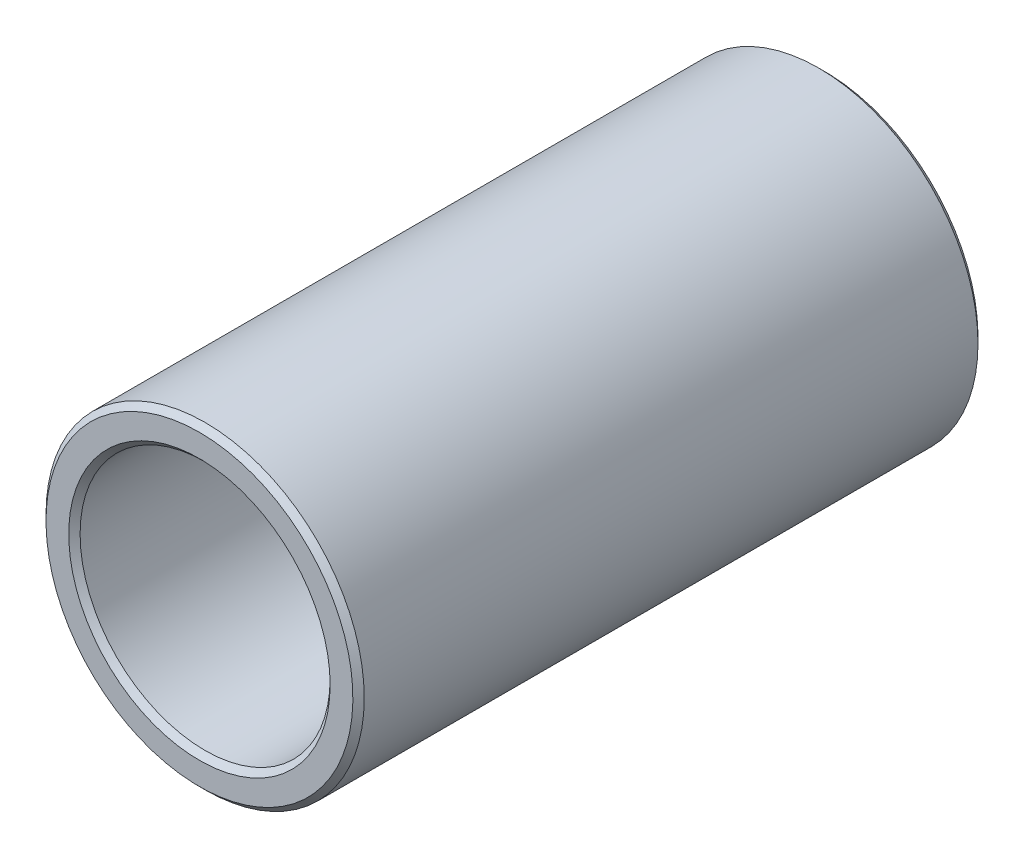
ISO-10303-21;
HEADER;
FILE_DESCRIPTION(('STEP AP214'),'2;1');
FILE_NAME('part.step','',(''),(''),'','','');
FILE_SCHEMA(('AUTOMOTIVE_DESIGN { 1 0 10303 214 1 1 1 1 }'));
ENDSEC;
DATA;
#1=APPLICATION_CONTEXT('core data for automotive mechanical design processes');
#2=APPLICATION_PROTOCOL_DEFINITION('international standard','automotive_design',2000,#1);
#3=PRODUCT_CONTEXT('',#1,'mechanical');
#4=PRODUCT('Part','Part','',(#3));
#5=PRODUCT_RELATED_PRODUCT_CATEGORY('part','',(#4));
#6=PRODUCT_DEFINITION_FORMATION('','',#4);
#7=PRODUCT_DEFINITION_CONTEXT('part definition',#1,'design');
#8=PRODUCT_DEFINITION('design','',#6,#7);
#9=PRODUCT_DEFINITION_SHAPE('','',#8);
#10=(LENGTH_UNIT() NAMED_UNIT(*) SI_UNIT(.MILLI.,.METRE.));
#11=(NAMED_UNIT(*) PLANE_ANGLE_UNIT() SI_UNIT($,.RADIAN.));
#12=(NAMED_UNIT(*) SI_UNIT($,.STERADIAN.) SOLID_ANGLE_UNIT());
#13=UNCERTAINTY_MEASURE_WITH_UNIT(LENGTH_MEASURE(1.E-05),#10,'distance_accuracy_value','');
#14=(GEOMETRIC_REPRESENTATION_CONTEXT(3) GLOBAL_UNCERTAINTY_ASSIGNED_CONTEXT((#13)) GLOBAL_UNIT_ASSIGNED_CONTEXT((#10,
#11,#12)) REPRESENTATION_CONTEXT('',''));
#15=CARTESIAN_POINT('',(0.,0.,0.));
#16=DIRECTION('',(0.,0.,1.));
#17=DIRECTION('',(1.,0.,0.));
#18=AXIS2_PLACEMENT_3D('',#15,#16,#17);
#19=CARTESIAN_POINT('',(0.,0.,0.));
#20=DIRECTION('',(0.,0.,1.));
#21=DIRECTION('',(1.,0.,0.));
#22=AXIS2_PLACEMENT_3D('',#19,#20,#21);
#23=CYLINDRICAL_SURFACE('',#22,11.);
#24=CARTESIAN_POINT('',(0.,0.,0.500000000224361));
#25=DIRECTION('',(0.,0.,-1.));
#26=DIRECTION('',(-1.,0.,0.));
#27=AXIS2_PLACEMENT_3D('',#24,#25,#26);
#28=CIRCLE('',#27,11.0000000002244);
#29=CARTESIAN_POINT('',(-11.0000000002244,0.,0.500000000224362));
#30=VERTEX_POINT('',#29);
#31=EDGE_CURVE('E34',#30,#30,#28,.T.);
#32=ORIENTED_EDGE('',*,*,#31,.T.);
#33=EDGE_LOOP('',(#32));
#34=FACE_BOUND('',#33,.T.);
#35=CARTESIAN_POINT('',(0.,0.,54.4999999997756));
#36=DIRECTION('',(0.,0.,1.));
#37=DIRECTION('',(-1.,0.,0.));
#38=AXIS2_PLACEMENT_3D('',#35,#36,#37);
#39=CIRCLE('',#38,11.0000000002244);
#40=CARTESIAN_POINT('',(-11.0000000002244,0.,54.4999999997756));
#41=VERTEX_POINT('',#40);
#42=EDGE_CURVE('E37',#41,#41,#39,.T.);
#43=ORIENTED_EDGE('',*,*,#42,.T.);
#44=EDGE_LOOP('',(#43));
#45=FACE_BOUND('',#44,.T.);
#46=ADVANCED_FACE('F15',(#34,#45),#23,.F.);
#47=CARTESIAN_POINT('',(0.,0.,55.0000000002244));
#48=DIRECTION('',(0.,0.,1.));
#49=DIRECTION('',(1.,0.,0.));
#50=AXIS2_PLACEMENT_3D('',#47,#48,#49);
#51=CONICAL_SURFACE('',#50,11.4999999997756,0.785398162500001);
#52=CARTESIAN_POINT('',(0.,0.,55.0000000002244));
#53=DIRECTION('',(0.,0.,1.));
#54=DIRECTION('',(1.,0.,0.));
#55=AXIS2_PLACEMENT_3D('',#52,#53,#54);
#56=CIRCLE('',#55,11.4999999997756);
#57=CARTESIAN_POINT('',(11.4999999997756,0.,55.0000000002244));
#58=VERTEX_POINT('',#57);
#59=EDGE_CURVE('E18',#58,#58,#56,.F.);
#60=ORIENTED_EDGE('',*,*,#59,.F.);
#61=EDGE_LOOP('',(#60));
#62=FACE_BOUND('',#61,.T.);
#63=ORIENTED_EDGE('',*,*,#42,.F.);
#64=EDGE_LOOP('',(#63));
#65=FACE_BOUND('',#64,.T.);
#66=ADVANCED_FACE('F58',(#62,#65),#51,.F.);
#67=CARTESIAN_POINT('',(0.,0.,-2.24363333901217E-10));
#68=DIRECTION('',(0.,0.,-1.));
#69=DIRECTION('',(-1.,0.,0.));
#70=AXIS2_PLACEMENT_3D('',#67,#68,#69);
#71=CONICAL_SURFACE('',#70,11.4999999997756,0.785398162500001);
#72=CARTESIAN_POINT('',(0.,0.,-2.24362954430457E-10));
#73=DIRECTION('',(0.,0.,-1.));
#74=DIRECTION('',(-1.,0.,0.));
#75=AXIS2_PLACEMENT_3D('',#72,#73,#74);
#76=CIRCLE('',#75,11.4999999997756);
#77=CARTESIAN_POINT('',(-11.4999999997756,0.,-2.24362954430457E-10));
#78=VERTEX_POINT('',#77);
#79=EDGE_CURVE('E48',#78,#78,#76,.T.);
#80=ORIENTED_EDGE('',*,*,#79,.T.);
#81=EDGE_LOOP('',(#80));
#82=FACE_BOUND('',#81,.T.);
#83=ORIENTED_EDGE('',*,*,#31,.F.);
#84=EDGE_LOOP('',(#83));
#85=FACE_BOUND('',#84,.T.);
#86=ADVANCED_FACE('F61',(#82,#85),#71,.F.);
#87=CARTESIAN_POINT('',(1.27272727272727,0.,55.));
#88=DIRECTION('',(0.,0.,1.));
#89=DIRECTION('',(1.,0.,0.));
#90=AXIS2_PLACEMENT_3D('',#87,#88,#89);
#91=PLANE('',#90);
#92=ORIENTED_EDGE('',*,*,#59,.T.);
#93=EDGE_LOOP('',(#92));
#94=FACE_BOUND('',#93,.T.);
#95=CARTESIAN_POINT('',(0.,0.,55.0000000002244));
#96=DIRECTION('',(0.,0.,-1.));
#97=DIRECTION('',(0.,1.,0.));
#98=AXIS2_PLACEMENT_3D('',#95,#96,#97);
#99=CIRCLE('',#98,13.5000000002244);
#100=CARTESIAN_POINT('',(0.,13.5000000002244,55.0000000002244));
#101=VERTEX_POINT('',#100);
#102=EDGE_CURVE('E46',#101,#101,#99,.T.);
#103=ORIENTED_EDGE('',*,*,#102,.F.);
#104=EDGE_LOOP('',(#103));
#105=FACE_BOUND('',#104,.T.);
#106=ADVANCED_FACE('F55',(#94,#105),#91,.T.);
#107=CARTESIAN_POINT('',(1.27272727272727,0.,0.));
#108=DIRECTION('',(0.,0.,1.));
#109=DIRECTION('',(1.,0.,0.));
#110=AXIS2_PLACEMENT_3D('',#107,#108,#109);
#111=PLANE('',#110);
#112=ORIENTED_EDGE('',*,*,#79,.F.);
#113=EDGE_LOOP('',(#112));
#114=FACE_BOUND('',#113,.T.);
#115=CARTESIAN_POINT('',(0.,0.,-2.24362087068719E-10));
#116=DIRECTION('',(0.,0.,1.));
#117=DIRECTION('',(0.,-1.,0.));
#118=AXIS2_PLACEMENT_3D('',#115,#116,#117);
#119=CIRCLE('',#118,13.5000000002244);
#120=CARTESIAN_POINT('',(0.,-13.5000000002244,-2.24362139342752E-10));
#121=VERTEX_POINT('',#120);
#122=EDGE_CURVE('E27',#121,#121,#119,.T.);
#123=ORIENTED_EDGE('',*,*,#122,.F.);
#124=EDGE_LOOP('',(#123));
#125=FACE_BOUND('',#124,.T.);
#126=ADVANCED_FACE('F83',(#114,#125),#111,.F.);
#127=CARTESIAN_POINT('',(0.,0.,54.4999999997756));
#128=DIRECTION('',(0.,0.,-1.));
#129=DIRECTION('',(0.,1.,0.));
#130=AXIS2_PLACEMENT_3D('',#127,#128,#129);
#131=CONICAL_SURFACE('',#130,13.9999999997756,0.785398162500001);
#132=CARTESIAN_POINT('',(0.,0.,54.5));
#133=DIRECTION('',(0.,0.,1.));
#134=DIRECTION('',(1.,0.,0.));
#135=AXIS2_PLACEMENT_3D('',#132,#133,#134);
#136=CIRCLE('',#135,14.);
#137=CARTESIAN_POINT('',(14.,0.,54.5));
#138=VERTEX_POINT('',#137);
#139=EDGE_CURVE('E22',#138,#138,#136,.F.);
#140=ORIENTED_EDGE('',*,*,#139,.F.);
#141=EDGE_LOOP('',(#140));
#142=FACE_BOUND('',#141,.T.);
#143=ORIENTED_EDGE('',*,*,#102,.T.);
#144=EDGE_LOOP('',(#143));
#145=FACE_BOUND('',#144,.T.);
#146=ADVANCED_FACE('F76',(#142,#145),#131,.T.);
#147=CARTESIAN_POINT('',(0.,0.,0.500000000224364));
#148=DIRECTION('',(0.,0.,1.));
#149=DIRECTION('',(0.,-1.,0.));
#150=AXIS2_PLACEMENT_3D('',#147,#148,#149);
#151=CONICAL_SURFACE('',#150,13.9999999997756,0.785398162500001);
#152=ORIENTED_EDGE('',*,*,#122,.T.);
#153=EDGE_LOOP('',(#152));
#154=FACE_BOUND('',#153,.T.);
#155=CARTESIAN_POINT('',(0.,0.,0.5));
#156=DIRECTION('',(0.,0.,1.));
#157=DIRECTION('',(1.,0.,0.));
#158=AXIS2_PLACEMENT_3D('',#155,#156,#157);
#159=CIRCLE('',#158,14.);
#160=CARTESIAN_POINT('',(14.,0.,0.5));
#161=VERTEX_POINT('',#160);
#162=EDGE_CURVE('E10',#161,#161,#159,.T.);
#163=ORIENTED_EDGE('',*,*,#162,.F.);
#164=EDGE_LOOP('',(#163));
#165=FACE_BOUND('',#164,.T.);
#166=ADVANCED_FACE('F71',(#154,#165),#151,.T.);
#167=CARTESIAN_POINT('',(0.,0.,0.));
#168=DIRECTION('',(0.,0.,1.));
#169=DIRECTION('',(1.,0.,0.));
#170=AXIS2_PLACEMENT_3D('',#167,#168,#169);
#171=CYLINDRICAL_SURFACE('',#170,14.);
#172=ORIENTED_EDGE('',*,*,#162,.T.);
#173=EDGE_LOOP('',(#172));
#174=FACE_BOUND('',#173,.T.);
#175=ORIENTED_EDGE('',*,*,#139,.T.);
#176=EDGE_LOOP('',(#175));
#177=FACE_BOUND('',#176,.T.);
#178=ADVANCED_FACE('F69',(#174,#177),#171,.T.);
#179=CLOSED_SHELL('',(#46,#66,#86,#106,#126,#146,#166,#178));
#180=MANIFOLD_SOLID_BREP('B1',#179);
#181=ADVANCED_BREP_SHAPE_REPRESENTATION('',(#18,#180),#14);
#182=SHAPE_DEFINITION_REPRESENTATION(#9,#181);
ENDSEC;
END-ISO-10303-21;
